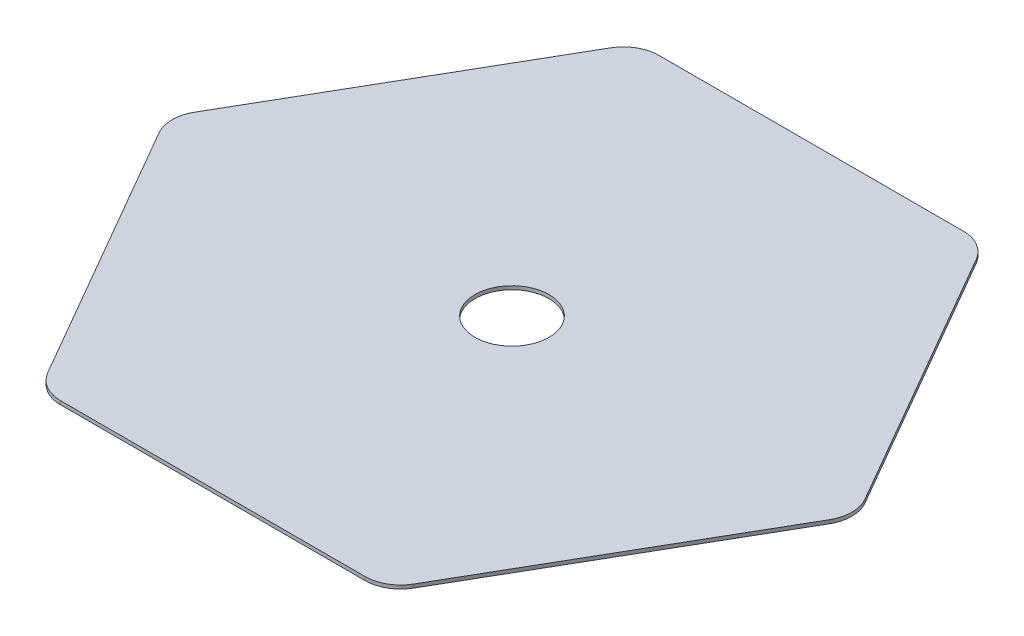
ISO-10303-21;
HEADER;
FILE_DESCRIPTION(('STEP AP214'),'2;1');
FILE_NAME('part.step','',(''),(''),'','','');
FILE_SCHEMA(('AUTOMOTIVE_DESIGN { 1 0 10303 214 1 1 1 1 }'));
ENDSEC;
DATA;
#1=APPLICATION_CONTEXT('core data for automotive mechanical design processes');
#2=APPLICATION_PROTOCOL_DEFINITION('international standard','automotive_design',2000,#1);
#3=PRODUCT_CONTEXT('',#1,'mechanical');
#4=PRODUCT('Part','Part','',(#3));
#5=PRODUCT_RELATED_PRODUCT_CATEGORY('part','',(#4));
#6=PRODUCT_DEFINITION_FORMATION('','',#4);
#7=PRODUCT_DEFINITION_CONTEXT('part definition',#1,'design');
#8=PRODUCT_DEFINITION('design','',#6,#7);
#9=PRODUCT_DEFINITION_SHAPE('','',#8);
#10=(LENGTH_UNIT() NAMED_UNIT(*) SI_UNIT(.MILLI.,.METRE.));
#11=(NAMED_UNIT(*) PLANE_ANGLE_UNIT() SI_UNIT($,.RADIAN.));
#12=(NAMED_UNIT(*) SI_UNIT($,.STERADIAN.) SOLID_ANGLE_UNIT());
#13=UNCERTAINTY_MEASURE_WITH_UNIT(LENGTH_MEASURE(1.E-05),#10,'distance_accuracy_value','');
#14=(GEOMETRIC_REPRESENTATION_CONTEXT(3) GLOBAL_UNCERTAINTY_ASSIGNED_CONTEXT((#13)) GLOBAL_UNIT_ASSIGNED_CONTEXT((#10,
#11,#12)) REPRESENTATION_CONTEXT('',''));
#15=CARTESIAN_POINT('',(0.,0.,0.));
#16=DIRECTION('',(0.,0.,1.));
#17=DIRECTION('',(1.,0.,0.));
#18=AXIS2_PLACEMENT_3D('',#15,#16,#17);
#19=CARTESIAN_POINT('',(-76.9896583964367,1.5875,-133.35));
#20=DIRECTION('',(0.866025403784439,0.,0.5));
#21=DIRECTION('',(0.5,0.,-0.866025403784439));
#22=AXIS2_PLACEMENT_3D('',#19,#20,#21);
#23=PLANE('',#22);
#24=DIRECTION('',(-0.5,0.,0.866025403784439));
#25=VECTOR('',#24,1.);
#26=CARTESIAN_POINT('',(-76.9896583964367,1.5875,-133.35));
#27=LINE('',#26,#25);
#28=CARTESIAN_POINT('',(-81.5723761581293,1.5875,-125.4125));
#29=VERTEX_POINT('',#28);
#30=CARTESIAN_POINT('',(-149.396599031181,1.5875,-7.93749999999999));
#31=VERTEX_POINT('',#30);
#32=EDGE_CURVE('E185',#29,#31,#27,.T.);
#33=ORIENTED_EDGE('',*,*,#32,.F.);
#34=DIRECTION('',(0.,-1.,0.));
#35=VECTOR('',#34,1.);
#36=CARTESIAN_POINT('',(-81.5723761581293,1.5875,-125.4125));
#37=LINE('',#36,#35);
#38=CARTESIAN_POINT('',(-81.5723761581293,0.,-125.4125));
#39=VERTEX_POINT('',#38);
#40=EDGE_CURVE('E11',#29,#39,#37,.T.);
#41=ORIENTED_EDGE('',*,*,#40,.T.);
#42=DIRECTION('',(-0.5,0.,0.866025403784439));
#43=VECTOR('',#42,1.);
#44=CARTESIAN_POINT('',(-76.9896583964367,0.,-133.35));
#45=LINE('',#44,#43);
#46=CARTESIAN_POINT('',(-149.396599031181,0.,-7.93749999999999));
#47=VERTEX_POINT('',#46);
#48=EDGE_CURVE('E175',#39,#47,#45,.T.);
#49=ORIENTED_EDGE('',*,*,#48,.T.);
#50=DIRECTION('',(0.,-1.,0.));
#51=VECTOR('',#50,1.);
#52=CARTESIAN_POINT('',(-149.396599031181,1.5875,-7.93749999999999));
#53=LINE('',#52,#51);
#54=EDGE_CURVE('E47',#47,#31,#53,.F.);
#55=ORIENTED_EDGE('',*,*,#54,.T.);
#56=EDGE_LOOP('',(#33,#41,#49,#55));
#57=FACE_BOUND('',#56,.T.);
#58=ADVANCED_FACE('F40',(#57),#23,.F.);
#59=CARTESIAN_POINT('',(-153.979316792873,1.5875,0.));
#60=DIRECTION('',(0.866025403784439,0.,-0.5));
#61=DIRECTION('',(-0.5,0.,-0.866025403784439));
#62=AXIS2_PLACEMENT_3D('',#59,#60,#61);
#63=PLANE('',#62);
#64=DIRECTION('',(0.5,0.,0.866025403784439));
#65=VECTOR('',#64,1.);
#66=CARTESIAN_POINT('',(-153.979316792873,0.,0.));
#67=LINE('',#66,#65);
#68=CARTESIAN_POINT('',(-149.396599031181,0.,7.9375));
#69=VERTEX_POINT('',#68);
#70=CARTESIAN_POINT('',(-81.5723761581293,0.,125.4125));
#71=VERTEX_POINT('',#70);
#72=EDGE_CURVE('E166',#69,#71,#67,.T.);
#73=ORIENTED_EDGE('',*,*,#72,.T.);
#74=DIRECTION('',(0.,-1.,0.));
#75=VECTOR('',#74,1.);
#76=CARTESIAN_POINT('',(-81.5723761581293,1.5875,125.4125));
#77=LINE('',#76,#75);
#78=CARTESIAN_POINT('',(-81.5723761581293,1.5875,125.4125));
#79=VERTEX_POINT('',#78);
#80=EDGE_CURVE('E143',#71,#79,#77,.F.);
#81=ORIENTED_EDGE('',*,*,#80,.T.);
#82=DIRECTION('',(0.5,0.,0.866025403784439));
#83=VECTOR('',#82,1.);
#84=CARTESIAN_POINT('',(-153.979316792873,1.5875,0.));
#85=LINE('',#84,#83);
#86=CARTESIAN_POINT('',(-149.396599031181,1.5875,7.9375));
#87=VERTEX_POINT('',#86);
#88=EDGE_CURVE('E188',#87,#79,#85,.T.);
#89=ORIENTED_EDGE('',*,*,#88,.F.);
#90=DIRECTION('',(0.,-1.,0.));
#91=VECTOR('',#90,1.);
#92=CARTESIAN_POINT('',(-149.396599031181,1.5875,7.9375));
#93=LINE('',#92,#91);
#94=EDGE_CURVE('E148',#87,#69,#93,.T.);
#95=ORIENTED_EDGE('',*,*,#94,.T.);
#96=EDGE_LOOP('',(#73,#81,#89,#95));
#97=FACE_BOUND('',#96,.T.);
#98=ADVANCED_FACE('F260',(#97),#63,.F.);
#99=CARTESIAN_POINT('',(-76.9896583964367,1.5875,133.35));
#100=DIRECTION('',(0.,0.,-1.));
#101=DIRECTION('',(-1.,0.,0.));
#102=AXIS2_PLACEMENT_3D('',#99,#100,#101);
#103=PLANE('',#102);
#104=DIRECTION('',(1.,0.,0.));
#105=VECTOR('',#104,1.);
#106=CARTESIAN_POINT('',(-76.9896583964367,1.5875,133.35));
#107=LINE('',#106,#105);
#108=CARTESIAN_POINT('',(-67.8242228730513,1.5875,133.35));
#109=VERTEX_POINT('',#108);
#110=CARTESIAN_POINT('',(67.8242228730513,1.5875,133.35));
#111=VERTEX_POINT('',#110);
#112=EDGE_CURVE('E158',#109,#111,#107,.T.);
#113=ORIENTED_EDGE('',*,*,#112,.F.);
#114=DIRECTION('',(0.,-1.,0.));
#115=VECTOR('',#114,1.);
#116=CARTESIAN_POINT('',(-67.8242228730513,1.5875,133.35));
#117=LINE('',#116,#115);
#118=CARTESIAN_POINT('',(-67.8242228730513,0.,133.35));
#119=VERTEX_POINT('',#118);
#120=EDGE_CURVE('E142',#109,#119,#117,.T.);
#121=ORIENTED_EDGE('',*,*,#120,.T.);
#122=DIRECTION('',(1.,0.,0.));
#123=VECTOR('',#122,1.);
#124=CARTESIAN_POINT('',(-76.9896583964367,0.,133.35));
#125=LINE('',#124,#123);
#126=CARTESIAN_POINT('',(67.8242228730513,0.,133.35));
#127=VERTEX_POINT('',#126);
#128=EDGE_CURVE('E155',#119,#127,#125,.T.);
#129=ORIENTED_EDGE('',*,*,#128,.T.);
#130=DIRECTION('',(0.,-1.,0.));
#131=VECTOR('',#130,1.);
#132=CARTESIAN_POINT('',(67.8242228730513,1.5875,133.35));
#133=LINE('',#132,#131);
#134=EDGE_CURVE('E160',#127,#111,#133,.F.);
#135=ORIENTED_EDGE('',*,*,#134,.T.);
#136=EDGE_LOOP('',(#113,#121,#129,#135));
#137=FACE_BOUND('',#136,.T.);
#138=ADVANCED_FACE('F154',(#137),#103,.F.);
#139=CARTESIAN_POINT('',(76.9896583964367,1.5875,133.35));
#140=DIRECTION('',(-0.866025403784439,0.,-0.5));
#141=DIRECTION('',(-0.5,0.,0.866025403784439));
#142=AXIS2_PLACEMENT_3D('',#139,#140,#141);
#143=PLANE('',#142);
#144=DIRECTION('',(0.5,0.,-0.866025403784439));
#145=VECTOR('',#144,1.);
#146=CARTESIAN_POINT('',(76.9896583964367,1.5875,133.35));
#147=LINE('',#146,#145);
#148=CARTESIAN_POINT('',(81.5723761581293,1.5875,125.4125));
#149=VERTEX_POINT('',#148);
#150=CARTESIAN_POINT('',(149.396599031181,1.5875,7.93749999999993));
#151=VERTEX_POINT('',#150);
#152=EDGE_CURVE('E193',#149,#151,#147,.T.);
#153=ORIENTED_EDGE('',*,*,#152,.F.);
#154=DIRECTION('',(0.,-1.,0.));
#155=VECTOR('',#154,1.);
#156=CARTESIAN_POINT('',(81.5723761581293,1.5875,125.4125));
#157=LINE('',#156,#155);
#158=CARTESIAN_POINT('',(81.5723761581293,0.,125.4125));
#159=VERTEX_POINT('',#158);
#160=EDGE_CURVE('E232',#149,#159,#157,.T.);
#161=ORIENTED_EDGE('',*,*,#160,.T.);
#162=DIRECTION('',(0.5,0.,-0.866025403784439));
#163=VECTOR('',#162,1.);
#164=CARTESIAN_POINT('',(76.9896583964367,0.,133.35));
#165=LINE('',#164,#163);
#166=CARTESIAN_POINT('',(149.396599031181,0.,7.93749999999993));
#167=VERTEX_POINT('',#166);
#168=EDGE_CURVE('E165',#159,#167,#165,.T.);
#169=ORIENTED_EDGE('',*,*,#168,.T.);
#170=DIRECTION('',(0.,-1.,0.));
#171=VECTOR('',#170,1.);
#172=CARTESIAN_POINT('',(149.396599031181,1.5875,7.93749999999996));
#173=LINE('',#172,#171);
#174=EDGE_CURVE('E229',#167,#151,#173,.F.);
#175=ORIENTED_EDGE('',*,*,#174,.T.);
#176=EDGE_LOOP('',(#153,#161,#169,#175));
#177=FACE_BOUND('',#176,.T.);
#178=ADVANCED_FACE('F293',(#177),#143,.F.);
#179=CARTESIAN_POINT('',(153.979316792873,1.5875,0.));
#180=DIRECTION('',(-0.866025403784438,0.,0.5));
#181=DIRECTION('',(0.5,0.,0.866025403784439));
#182=AXIS2_PLACEMENT_3D('',#179,#180,#181);
#183=PLANE('',#182);
#184=DIRECTION('',(-0.5,0.,-0.866025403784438));
#185=VECTOR('',#184,1.);
#186=CARTESIAN_POINT('',(153.979316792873,1.5875,0.));
#187=LINE('',#186,#185);
#188=CARTESIAN_POINT('',(149.396599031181,1.5875,-7.93750000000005));
#189=VERTEX_POINT('',#188);
#190=CARTESIAN_POINT('',(81.5723761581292,1.5875,-125.4125));
#191=VERTEX_POINT('',#190);
#192=EDGE_CURVE('E197',#189,#191,#187,.T.);
#193=ORIENTED_EDGE('',*,*,#192,.F.);
#194=DIRECTION('',(0.,-1.,0.));
#195=VECTOR('',#194,1.);
#196=CARTESIAN_POINT('',(149.396599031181,1.5875,-7.93750000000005));
#197=LINE('',#196,#195);
#198=CARTESIAN_POINT('',(149.396599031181,0.,-7.93750000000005));
#199=VERTEX_POINT('',#198);
#200=EDGE_CURVE('E238',#189,#199,#197,.T.);
#201=ORIENTED_EDGE('',*,*,#200,.T.);
#202=DIRECTION('',(-0.5,0.,-0.866025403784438));
#203=VECTOR('',#202,1.);
#204=CARTESIAN_POINT('',(153.979316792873,0.,0.));
#205=LINE('',#204,#203);
#206=CARTESIAN_POINT('',(81.5723761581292,0.,-125.4125));
#207=VERTEX_POINT('',#206);
#208=EDGE_CURVE('E172',#199,#207,#205,.T.);
#209=ORIENTED_EDGE('',*,*,#208,.T.);
#210=DIRECTION('',(0.,-1.,0.));
#211=VECTOR('',#210,1.);
#212=CARTESIAN_POINT('',(81.5723761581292,1.5875,-125.4125));
#213=LINE('',#212,#211);
#214=EDGE_CURVE('E235',#207,#191,#213,.F.);
#215=ORIENTED_EDGE('',*,*,#214,.T.);
#216=EDGE_LOOP('',(#193,#201,#209,#215));
#217=FACE_BOUND('',#216,.T.);
#218=ADVANCED_FACE('F298',(#217),#183,.F.);
#219=CARTESIAN_POINT('',(76.9896583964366,1.5875,-133.35));
#220=DIRECTION('',(0.,0.,1.));
#221=DIRECTION('',(1.,0.,0.));
#222=AXIS2_PLACEMENT_3D('',#219,#220,#221);
#223=PLANE('',#222);
#224=DIRECTION('',(-1.,0.,0.));
#225=VECTOR('',#224,1.);
#226=CARTESIAN_POINT('',(76.9896583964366,1.5875,-133.35));
#227=LINE('',#226,#225);
#228=CARTESIAN_POINT('',(67.8242228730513,1.5875,-133.35));
#229=VERTEX_POINT('',#228);
#230=CARTESIAN_POINT('',(-67.8242228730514,1.5875,-133.35));
#231=VERTEX_POINT('',#230);
#232=EDGE_CURVE('E200',#229,#231,#227,.T.);
#233=ORIENTED_EDGE('',*,*,#232,.F.);
#234=DIRECTION('',(0.,-1.,0.));
#235=VECTOR('',#234,1.);
#236=CARTESIAN_POINT('',(67.8242228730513,1.5875,-133.35));
#237=LINE('',#236,#235);
#238=CARTESIAN_POINT('',(67.8242228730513,0.,-133.35));
#239=VERTEX_POINT('',#238);
#240=EDGE_CURVE('E243',#229,#239,#237,.T.);
#241=ORIENTED_EDGE('',*,*,#240,.T.);
#242=DIRECTION('',(-1.,0.,0.));
#243=VECTOR('',#242,1.);
#244=CARTESIAN_POINT('',(76.9896583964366,0.,-133.35));
#245=LINE('',#244,#243);
#246=CARTESIAN_POINT('',(-67.8242228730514,0.,-133.35));
#247=VERTEX_POINT('',#246);
#248=EDGE_CURVE('E182',#239,#247,#245,.T.);
#249=ORIENTED_EDGE('',*,*,#248,.T.);
#250=DIRECTION('',(0.,-1.,0.));
#251=VECTOR('',#250,1.);
#252=CARTESIAN_POINT('',(-67.8242228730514,1.5875,-133.35));
#253=LINE('',#252,#251);
#254=EDGE_CURVE('E54',#247,#231,#253,.F.);
#255=ORIENTED_EDGE('',*,*,#254,.T.);
#256=EDGE_LOOP('',(#233,#241,#249,#255));
#257=FACE_BOUND('',#256,.T.);
#258=ADVANCED_FACE('F283',(#257),#223,.F.);
#259=CARTESIAN_POINT('',(0.,1.5875,-266.7));
#260=DIRECTION('',(0.,-1.,0.));
#261=DIRECTION('',(0.,0.,-1.));
#262=AXIS2_PLACEMENT_3D('',#259,#260,#261);
#263=PLANE('',#262);
#264=CARTESIAN_POINT('',(0.,1.5875,0.));
#265=DIRECTION('',(0.,-1.,0.));
#266=DIRECTION('',(0.,0.,-1.));
#267=AXIS2_PLACEMENT_3D('',#264,#265,#266);
#268=CIRCLE('',#267,16.51);
#269=CARTESIAN_POINT('',(0.,1.5875,-16.51));
#270=VERTEX_POINT('',#269);
#271=EDGE_CURVE('E262',#270,#270,#268,.T.);
#272=ORIENTED_EDGE('',*,*,#271,.T.);
#273=EDGE_LOOP('',(#272));
#274=FACE_BOUND('',#273,.T.);
#275=ORIENTED_EDGE('',*,*,#88,.T.);
#276=CARTESIAN_POINT('',(-67.8242228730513,1.5875,117.475));
#277=DIRECTION('',(0.,-1.,0.));
#278=DIRECTION('',(0.,0.,-1.));
#279=AXIS2_PLACEMENT_3D('',#276,#277,#278);
#280=CIRCLE('',#279,15.875);
#281=EDGE_CURVE('E227',#79,#109,#280,.F.);
#282=ORIENTED_EDGE('',*,*,#281,.T.);
#283=ORIENTED_EDGE('',*,*,#112,.T.);
#284=CARTESIAN_POINT('',(67.8242228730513,1.5875,117.475));
#285=DIRECTION('',(0.,-1.,0.));
#286=DIRECTION('',(0.,0.,-1.));
#287=AXIS2_PLACEMENT_3D('',#284,#285,#286);
#288=CIRCLE('',#287,15.875);
#289=EDGE_CURVE('E225',#111,#149,#288,.F.);
#290=ORIENTED_EDGE('',*,*,#289,.T.);
#291=ORIENTED_EDGE('',*,*,#152,.T.);
#292=CARTESIAN_POINT('',(135.648445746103,1.5875,0.));
#293=DIRECTION('',(0.,-1.,0.));
#294=DIRECTION('',(0.,0.,-1.));
#295=AXIS2_PLACEMENT_3D('',#292,#293,#294);
#296=CIRCLE('',#295,15.875);
#297=EDGE_CURVE('E222',#151,#189,#296,.F.);
#298=ORIENTED_EDGE('',*,*,#297,.T.);
#299=ORIENTED_EDGE('',*,*,#192,.T.);
#300=CARTESIAN_POINT('',(67.8242228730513,1.5875,-117.475));
#301=DIRECTION('',(0.,-1.,0.));
#302=DIRECTION('',(0.,0.,-1.));
#303=AXIS2_PLACEMENT_3D('',#300,#301,#302);
#304=CIRCLE('',#303,15.875);
#305=EDGE_CURVE('E64',#191,#229,#304,.F.);
#306=ORIENTED_EDGE('',*,*,#305,.T.);
#307=ORIENTED_EDGE('',*,*,#232,.T.);
#308=CARTESIAN_POINT('',(-67.8242228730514,1.5875,-117.475));
#309=DIRECTION('',(0.,-1.,0.));
#310=DIRECTION('',(0.,0.,-1.));
#311=AXIS2_PLACEMENT_3D('',#308,#309,#310);
#312=CIRCLE('',#311,15.875);
#313=EDGE_CURVE('E219',#231,#29,#312,.F.);
#314=ORIENTED_EDGE('',*,*,#313,.T.);
#315=ORIENTED_EDGE('',*,*,#32,.T.);
#316=CARTESIAN_POINT('',(-135.648445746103,1.5875,0.));
#317=DIRECTION('',(0.,-1.,0.));
#318=DIRECTION('',(0.,0.,-1.));
#319=AXIS2_PLACEMENT_3D('',#316,#317,#318);
#320=CIRCLE('',#319,15.875);
#321=EDGE_CURVE('E217',#31,#87,#320,.F.);
#322=ORIENTED_EDGE('',*,*,#321,.T.);
#323=EDGE_LOOP('',(#275,#282,#283,#290,#291,#298,#299,#306,#307,#314,#315,#322));
#324=FACE_BOUND('',#323,.T.);
#325=ADVANCED_FACE('F254',(#274,#324),#263,.F.);
#326=CARTESIAN_POINT('',(0.,0.,-266.7));
#327=DIRECTION('',(0.,-1.,0.));
#328=DIRECTION('',(0.,0.,-1.));
#329=AXIS2_PLACEMENT_3D('',#326,#327,#328);
#330=PLANE('',#329);
#331=CARTESIAN_POINT('',(0.,0.,0.));
#332=DIRECTION('',(0.,-1.,0.));
#333=DIRECTION('',(0.,0.,-1.));
#334=AXIS2_PLACEMENT_3D('',#331,#332,#333);
#335=CIRCLE('',#334,16.51);
#336=CARTESIAN_POINT('',(0.,0.,-16.51));
#337=VERTEX_POINT('',#336);
#338=EDGE_CURVE('E265',#337,#337,#335,.T.);
#339=ORIENTED_EDGE('',*,*,#338,.F.);
#340=EDGE_LOOP('',(#339));
#341=FACE_BOUND('',#340,.T.);
#342=ORIENTED_EDGE('',*,*,#128,.F.);
#343=CARTESIAN_POINT('',(-67.8242228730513,0.,117.475));
#344=DIRECTION('',(0.,-1.,0.));
#345=DIRECTION('',(0.,0.,-1.));
#346=AXIS2_PLACEMENT_3D('',#343,#344,#345);
#347=CIRCLE('',#346,15.875);
#348=EDGE_CURVE('E138',#119,#71,#347,.T.);
#349=ORIENTED_EDGE('',*,*,#348,.T.);
#350=ORIENTED_EDGE('',*,*,#72,.F.);
#351=CARTESIAN_POINT('',(-135.648445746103,0.,0.));
#352=DIRECTION('',(0.,-1.,0.));
#353=DIRECTION('',(0.,0.,-1.));
#354=AXIS2_PLACEMENT_3D('',#351,#352,#353);
#355=CIRCLE('',#354,15.875);
#356=EDGE_CURVE('E159',#69,#47,#355,.T.);
#357=ORIENTED_EDGE('',*,*,#356,.T.);
#358=ORIENTED_EDGE('',*,*,#48,.F.);
#359=CARTESIAN_POINT('',(-67.8242228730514,0.,-117.475));
#360=DIRECTION('',(0.,-1.,0.));
#361=DIRECTION('',(0.,0.,-1.));
#362=AXIS2_PLACEMENT_3D('',#359,#360,#361);
#363=CIRCLE('',#362,15.875);
#364=EDGE_CURVE('E205',#39,#247,#363,.T.);
#365=ORIENTED_EDGE('',*,*,#364,.T.);
#366=ORIENTED_EDGE('',*,*,#248,.F.);
#367=CARTESIAN_POINT('',(67.8242228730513,0.,-117.475));
#368=DIRECTION('',(0.,-1.,0.));
#369=DIRECTION('',(0.,0.,-1.));
#370=AXIS2_PLACEMENT_3D('',#367,#368,#369);
#371=CIRCLE('',#370,15.875);
#372=EDGE_CURVE('E207',#239,#207,#371,.T.);
#373=ORIENTED_EDGE('',*,*,#372,.T.);
#374=ORIENTED_EDGE('',*,*,#208,.F.);
#375=CARTESIAN_POINT('',(135.648445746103,0.,0.));
#376=DIRECTION('',(0.,-1.,0.));
#377=DIRECTION('',(0.,0.,-1.));
#378=AXIS2_PLACEMENT_3D('',#375,#376,#377);
#379=CIRCLE('',#378,15.875);
#380=EDGE_CURVE('E210',#199,#167,#379,.T.);
#381=ORIENTED_EDGE('',*,*,#380,.T.);
#382=ORIENTED_EDGE('',*,*,#168,.F.);
#383=CARTESIAN_POINT('',(67.8242228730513,0.,117.475));
#384=DIRECTION('',(0.,-1.,0.));
#385=DIRECTION('',(0.,0.,-1.));
#386=AXIS2_PLACEMENT_3D('',#383,#384,#385);
#387=CIRCLE('',#386,15.875);
#388=EDGE_CURVE('E149',#159,#127,#387,.T.);
#389=ORIENTED_EDGE('',*,*,#388,.T.);
#390=EDGE_LOOP('',(#342,#349,#350,#357,#358,#365,#366,#373,#374,#381,#382,#389));
#391=FACE_BOUND('',#390,.T.);
#392=ADVANCED_FACE('F162',(#341,#391),#330,.T.);
#393=CARTESIAN_POINT('',(-67.8242228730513,1.5875,117.475));
#394=DIRECTION('',(0.,-1.,0.));
#395=DIRECTION('',(0.,0.,-1.));
#396=AXIS2_PLACEMENT_3D('',#393,#394,#395);
#397=CYLINDRICAL_SURFACE('',#396,15.875);
#398=ORIENTED_EDGE('',*,*,#281,.F.);
#399=ORIENTED_EDGE('',*,*,#80,.F.);
#400=ORIENTED_EDGE('',*,*,#348,.F.);
#401=ORIENTED_EDGE('',*,*,#120,.F.);
#402=EDGE_LOOP('',(#398,#399,#400,#401));
#403=FACE_BOUND('',#402,.T.);
#404=ADVANCED_FACE('F141',(#403),#397,.T.);
#405=CARTESIAN_POINT('',(67.8242228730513,1.5875,117.475));
#406=DIRECTION('',(0.,-1.,0.));
#407=DIRECTION('',(0.,0.,-1.));
#408=AXIS2_PLACEMENT_3D('',#405,#406,#407);
#409=CYLINDRICAL_SURFACE('',#408,15.875);
#410=ORIENTED_EDGE('',*,*,#289,.F.);
#411=ORIENTED_EDGE('',*,*,#134,.F.);
#412=ORIENTED_EDGE('',*,*,#388,.F.);
#413=ORIENTED_EDGE('',*,*,#160,.F.);
#414=EDGE_LOOP('',(#410,#411,#412,#413));
#415=FACE_BOUND('',#414,.T.);
#416=ADVANCED_FACE('F281',(#415),#409,.T.);
#417=CARTESIAN_POINT('',(135.648445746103,1.5875,0.));
#418=DIRECTION('',(0.,-1.,0.));
#419=DIRECTION('',(0.,0.,-1.));
#420=AXIS2_PLACEMENT_3D('',#417,#418,#419);
#421=CYLINDRICAL_SURFACE('',#420,15.875);
#422=ORIENTED_EDGE('',*,*,#297,.F.);
#423=ORIENTED_EDGE('',*,*,#174,.F.);
#424=ORIENTED_EDGE('',*,*,#380,.F.);
#425=ORIENTED_EDGE('',*,*,#200,.F.);
#426=EDGE_LOOP('',(#422,#423,#424,#425));
#427=FACE_BOUND('',#426,.T.);
#428=ADVANCED_FACE('F315',(#427),#421,.T.);
#429=CARTESIAN_POINT('',(67.8242228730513,1.5875,-117.475));
#430=DIRECTION('',(0.,-1.,0.));
#431=DIRECTION('',(0.,0.,-1.));
#432=AXIS2_PLACEMENT_3D('',#429,#430,#431);
#433=CYLINDRICAL_SURFACE('',#432,15.875);
#434=ORIENTED_EDGE('',*,*,#305,.F.);
#435=ORIENTED_EDGE('',*,*,#214,.F.);
#436=ORIENTED_EDGE('',*,*,#372,.F.);
#437=ORIENTED_EDGE('',*,*,#240,.F.);
#438=EDGE_LOOP('',(#434,#435,#436,#437));
#439=FACE_BOUND('',#438,.T.);
#440=ADVANCED_FACE('F308',(#439),#433,.T.);
#441=CARTESIAN_POINT('',(-67.8242228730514,1.5875,-117.475));
#442=DIRECTION('',(0.,-1.,0.));
#443=DIRECTION('',(0.,0.,-1.));
#444=AXIS2_PLACEMENT_3D('',#441,#442,#443);
#445=CYLINDRICAL_SURFACE('',#444,15.875);
#446=ORIENTED_EDGE('',*,*,#313,.F.);
#447=ORIENTED_EDGE('',*,*,#254,.F.);
#448=ORIENTED_EDGE('',*,*,#364,.F.);
#449=ORIENTED_EDGE('',*,*,#40,.F.);
#450=EDGE_LOOP('',(#446,#447,#448,#449));
#451=FACE_BOUND('',#450,.T.);
#452=ADVANCED_FACE('F330',(#451),#445,.T.);
#453=CARTESIAN_POINT('',(-135.648445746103,1.5875,0.));
#454=DIRECTION('',(0.,-1.,0.));
#455=DIRECTION('',(0.,0.,-1.));
#456=AXIS2_PLACEMENT_3D('',#453,#454,#455);
#457=CYLINDRICAL_SURFACE('',#456,15.875);
#458=ORIENTED_EDGE('',*,*,#321,.F.);
#459=ORIENTED_EDGE('',*,*,#54,.F.);
#460=ORIENTED_EDGE('',*,*,#356,.F.);
#461=ORIENTED_EDGE('',*,*,#94,.F.);
#462=EDGE_LOOP('',(#458,#459,#460,#461));
#463=FACE_BOUND('',#462,.T.);
#464=ADVANCED_FACE('F258',(#463),#457,.T.);
#465=CARTESIAN_POINT('',(0.,0.,0.));
#466=DIRECTION('',(0.,-1.,0.));
#467=DIRECTION('',(0.,0.,-1.));
#468=AXIS2_PLACEMENT_3D('',#465,#466,#467);
#469=CYLINDRICAL_SURFACE('',#468,16.51);
#470=ORIENTED_EDGE('',*,*,#338,.T.);
#471=EDGE_LOOP('',(#470));
#472=FACE_BOUND('',#471,.T.);
#473=ORIENTED_EDGE('',*,*,#271,.F.);
#474=EDGE_LOOP('',(#473));
#475=FACE_BOUND('',#474,.T.);
#476=ADVANCED_FACE('F272',(#472,#475),#469,.F.);
#477=CLOSED_SHELL('',(#58,#98,#138,#178,#218,#258,#325,#392,#404,#416,#428,#440,#452,#464,#476));
#478=MANIFOLD_SOLID_BREP('B2',#477);
#479=ADVANCED_BREP_SHAPE_REPRESENTATION('',(#18,#478),#14);
#480=SHAPE_DEFINITION_REPRESENTATION(#9,#479);
ENDSEC;
END-ISO-10303-21;
